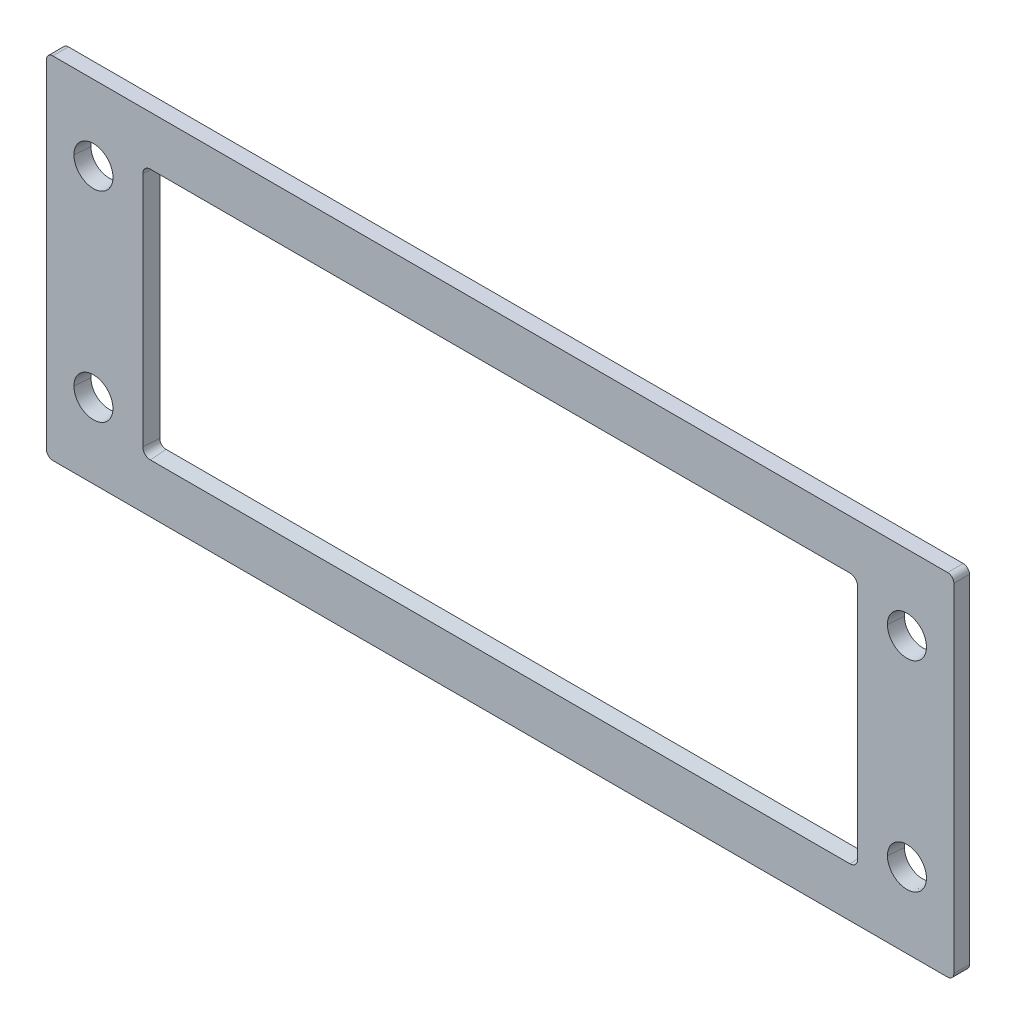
ISO-10303-21;
HEADER;
FILE_DESCRIPTION(('STEP AP214'),'2;1');
FILE_NAME('part.step','',(''),(''),'','','');
FILE_SCHEMA(('AUTOMOTIVE_DESIGN { 1 0 10303 214 1 1 1 1 }'));
ENDSEC;
DATA;
#1=APPLICATION_CONTEXT('core data for automotive mechanical design processes');
#2=APPLICATION_PROTOCOL_DEFINITION('international standard','automotive_design',2000,#1);
#3=PRODUCT_CONTEXT('',#1,'mechanical');
#4=PRODUCT('Part','Part','',(#3));
#5=PRODUCT_RELATED_PRODUCT_CATEGORY('part','',(#4));
#6=PRODUCT_DEFINITION_FORMATION('','',#4);
#7=PRODUCT_DEFINITION_CONTEXT('part definition',#1,'design');
#8=PRODUCT_DEFINITION('design','',#6,#7);
#9=PRODUCT_DEFINITION_SHAPE('','',#8);
#10=(LENGTH_UNIT() NAMED_UNIT(*) SI_UNIT(.MILLI.,.METRE.));
#11=(NAMED_UNIT(*) PLANE_ANGLE_UNIT() SI_UNIT($,.RADIAN.));
#12=(NAMED_UNIT(*) SI_UNIT($,.STERADIAN.) SOLID_ANGLE_UNIT());
#13=UNCERTAINTY_MEASURE_WITH_UNIT(LENGTH_MEASURE(1.E-05),#10,'distance_accuracy_value','');
#14=(GEOMETRIC_REPRESENTATION_CONTEXT(3) GLOBAL_UNCERTAINTY_ASSIGNED_CONTEXT((#13)) GLOBAL_UNIT_ASSIGNED_CONTEXT((#10,
#11,#12)) REPRESENTATION_CONTEXT('',''));
#15=CARTESIAN_POINT('',(0.,0.,0.));
#16=DIRECTION('',(0.,0.,1.));
#17=DIRECTION('',(1.,0.,0.));
#18=AXIS2_PLACEMENT_3D('',#15,#16,#17);
#19=CARTESIAN_POINT('',(17.6,10.1,-2.49999999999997));
#20=DIRECTION('',(0.,0.,1.));
#21=DIRECTION('',(-1.,0.,0.));
#22=AXIS2_PLACEMENT_3D('',#19,#20,#21);
#23=CONICAL_SURFACE('',#22,1.,0.0872664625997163);
#24=CARTESIAN_POINT('',(17.6,10.1,0.));
#25=DIRECTION('',(0.,0.,-1.));
#26=DIRECTION('',(-1.,0.,0.));
#27=AXIS2_PLACEMENT_3D('',#24,#25,#26);
#28=CIRCLE('',#27,1.21872165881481);
#29=CARTESIAN_POINT('',(17.6,8.88127834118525,0.));
#30=VERTEX_POINT('',#29);
#31=CARTESIAN_POINT('',(16.3812783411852,10.1,0.));
#32=VERTEX_POINT('',#31);
#33=EDGE_CURVE('E254',#30,#32,#28,.T.);
#34=ORIENTED_EDGE('',*,*,#33,.F.);
#35=DIRECTION('',(0.,-0.0871557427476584,0.996194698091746));
#36=VECTOR('',#35,1.);
#37=CARTESIAN_POINT('',(17.6,9.1,-2.49999999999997));
#38=LINE('',#37,#36);
#39=CARTESIAN_POINT('',(17.6,9.1,-2.49999999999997));
#40=VERTEX_POINT('',#39);
#41=EDGE_CURVE('E10',#40,#30,#38,.T.);
#42=ORIENTED_EDGE('',*,*,#41,.F.);
#43=CARTESIAN_POINT('',(17.6,10.1,-2.49999999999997));
#44=DIRECTION('',(0.,0.,1.));
#45=DIRECTION('',(-1.,0.,0.));
#46=AXIS2_PLACEMENT_3D('',#43,#44,#45);
#47=CIRCLE('',#46,1.);
#48=CARTESIAN_POINT('',(16.6,10.1,-2.49999999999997));
#49=VERTEX_POINT('',#48);
#50=EDGE_CURVE('E334',#49,#40,#47,.T.);
#51=ORIENTED_EDGE('',*,*,#50,.F.);
#52=DIRECTION('',(0.0871557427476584,0.,-0.996194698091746));
#53=VECTOR('',#52,1.);
#54=CARTESIAN_POINT('',(16.6,10.1,-2.49999999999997));
#55=LINE('',#54,#53);
#56=EDGE_CURVE('E124',#32,#49,#55,.T.);
#57=ORIENTED_EDGE('',*,*,#56,.F.);
#58=EDGE_LOOP('',(#34,#42,#51,#57));
#59=FACE_BOUND('',#58,.T.);
#60=ADVANCED_FACE('F15',(#59),#23,.F.);
#61=CARTESIAN_POINT('',(17.6,47.9,-2.49999999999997));
#62=DIRECTION('',(0.,0.,1.));
#63=DIRECTION('',(-1.,0.,0.));
#64=AXIS2_PLACEMENT_3D('',#61,#62,#63);
#65=CONICAL_SURFACE('',#64,1.,0.0872664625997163);
#66=CARTESIAN_POINT('',(17.6,47.9,0.));
#67=DIRECTION('',(0.,0.,-1.));
#68=DIRECTION('',(-1.,0.,0.));
#69=AXIS2_PLACEMENT_3D('',#66,#67,#68);
#70=CIRCLE('',#69,1.21872165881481);
#71=CARTESIAN_POINT('',(16.3812783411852,47.9,0.));
#72=VERTEX_POINT('',#71);
#73=CARTESIAN_POINT('',(17.6,49.1187216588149,0.));
#74=VERTEX_POINT('',#73);
#75=EDGE_CURVE('E268',#72,#74,#70,.T.);
#76=ORIENTED_EDGE('',*,*,#75,.F.);
#77=DIRECTION('',(-0.0871557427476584,0.,0.996194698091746));
#78=VECTOR('',#77,1.);
#79=CARTESIAN_POINT('',(16.6,47.9,-2.49999999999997));
#80=LINE('',#79,#78);
#81=CARTESIAN_POINT('',(16.6,47.9,-2.49999999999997));
#82=VERTEX_POINT('',#81);
#83=EDGE_CURVE('E116',#82,#72,#80,.T.);
#84=ORIENTED_EDGE('',*,*,#83,.F.);
#85=CARTESIAN_POINT('',(17.6,47.9,-2.49999999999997));
#86=DIRECTION('',(0.,0.,1.));
#87=DIRECTION('',(-1.,0.,0.));
#88=AXIS2_PLACEMENT_3D('',#85,#86,#87);
#89=CIRCLE('',#88,1.);
#90=CARTESIAN_POINT('',(17.6,48.9,-2.49999999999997));
#91=VERTEX_POINT('',#90);
#92=EDGE_CURVE('E216',#91,#82,#89,.T.);
#93=ORIENTED_EDGE('',*,*,#92,.F.);
#94=DIRECTION('',(0.,-0.0871557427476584,-0.996194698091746));
#95=VECTOR('',#94,1.);
#96=CARTESIAN_POINT('',(17.6,48.9,-2.49999999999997));
#97=LINE('',#96,#95);
#98=EDGE_CURVE('E38',#74,#91,#97,.T.);
#99=ORIENTED_EDGE('',*,*,#98,.F.);
#100=EDGE_LOOP('',(#76,#84,#93,#99));
#101=FACE_BOUND('',#100,.T.);
#102=ADVANCED_FACE('F476',(#101),#65,.F.);
#103=CARTESIAN_POINT('',(129.4,47.9,-2.49999999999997));
#104=DIRECTION('',(0.,0.,1.));
#105=DIRECTION('',(-1.,0.,0.));
#106=AXIS2_PLACEMENT_3D('',#103,#104,#105);
#107=CONICAL_SURFACE('',#106,1.,0.0872664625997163);
#108=CARTESIAN_POINT('',(129.4,47.9,0.));
#109=DIRECTION('',(0.,0.,-1.));
#110=DIRECTION('',(-1.,0.,0.));
#111=AXIS2_PLACEMENT_3D('',#108,#109,#110);
#112=CIRCLE('',#111,1.21872165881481);
#113=CARTESIAN_POINT('',(129.4,49.1187216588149,0.));
#114=VERTEX_POINT('',#113);
#115=CARTESIAN_POINT('',(130.618721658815,47.9,0.));
#116=VERTEX_POINT('',#115);
#117=EDGE_CURVE('E278',#114,#116,#112,.T.);
#118=ORIENTED_EDGE('',*,*,#117,.F.);
#119=DIRECTION('',(0.,0.0871557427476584,0.996194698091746));
#120=VECTOR('',#119,1.);
#121=CARTESIAN_POINT('',(129.4,48.9,-2.49999999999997));
#122=LINE('',#121,#120);
#123=CARTESIAN_POINT('',(129.4,48.9,-2.49999999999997));
#124=VERTEX_POINT('',#123);
#125=EDGE_CURVE('E270',#124,#114,#122,.T.);
#126=ORIENTED_EDGE('',*,*,#125,.F.);
#127=CARTESIAN_POINT('',(129.4,47.9,-2.49999999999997));
#128=DIRECTION('',(0.,0.,1.));
#129=DIRECTION('',(-1.,0.,0.));
#130=AXIS2_PLACEMENT_3D('',#127,#128,#129);
#131=CIRCLE('',#130,1.);
#132=CARTESIAN_POINT('',(130.4,47.9,-2.49999999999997));
#133=VERTEX_POINT('',#132);
#134=EDGE_CURVE('E213',#133,#124,#131,.T.);
#135=ORIENTED_EDGE('',*,*,#134,.F.);
#136=DIRECTION('',(-0.0871557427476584,0.,-0.996194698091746));
#137=VECTOR('',#136,1.);
#138=CARTESIAN_POINT('',(130.4,47.9,-2.49999999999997));
#139=LINE('',#138,#137);
#140=EDGE_CURVE('E221',#116,#133,#139,.T.);
#141=ORIENTED_EDGE('',*,*,#140,.F.);
#142=EDGE_LOOP('',(#118,#126,#135,#141));
#143=FACE_BOUND('',#142,.T.);
#144=ADVANCED_FACE('F456',(#143),#107,.F.);
#145=CARTESIAN_POINT('',(129.4,10.1,-2.49999999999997));
#146=DIRECTION('',(0.,0.,1.));
#147=DIRECTION('',(-1.,0.,0.));
#148=AXIS2_PLACEMENT_3D('',#145,#146,#147);
#149=CONICAL_SURFACE('',#148,1.,0.0872664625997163);
#150=CARTESIAN_POINT('',(129.4,10.1,0.));
#151=DIRECTION('',(0.,0.,-1.));
#152=DIRECTION('',(-1.,0.,0.));
#153=AXIS2_PLACEMENT_3D('',#150,#151,#152);
#154=CIRCLE('',#153,1.21872165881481);
#155=CARTESIAN_POINT('',(130.618721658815,10.1,0.));
#156=VERTEX_POINT('',#155);
#157=CARTESIAN_POINT('',(129.4,8.88127834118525,0.));
#158=VERTEX_POINT('',#157);
#159=EDGE_CURVE('E243',#156,#158,#154,.T.);
#160=ORIENTED_EDGE('',*,*,#159,.F.);
#161=DIRECTION('',(0.0871557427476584,0.,0.996194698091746));
#162=VECTOR('',#161,1.);
#163=CARTESIAN_POINT('',(130.4,10.1,-2.49999999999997));
#164=LINE('',#163,#162);
#165=CARTESIAN_POINT('',(130.4,10.1,-2.49999999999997));
#166=VERTEX_POINT('',#165);
#167=EDGE_CURVE('E218',#166,#156,#164,.T.);
#168=ORIENTED_EDGE('',*,*,#167,.F.);
#169=CARTESIAN_POINT('',(129.4,10.1,-2.49999999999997));
#170=DIRECTION('',(0.,0.,1.));
#171=DIRECTION('',(-1.,0.,0.));
#172=AXIS2_PLACEMENT_3D('',#169,#170,#171);
#173=CIRCLE('',#172,1.);
#174=CARTESIAN_POINT('',(129.4,9.1,-2.49999999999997));
#175=VERTEX_POINT('',#174);
#176=EDGE_CURVE('E434',#175,#166,#173,.T.);
#177=ORIENTED_EDGE('',*,*,#176,.F.);
#178=DIRECTION('',(0.,0.0871557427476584,-0.996194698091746));
#179=VECTOR('',#178,1.);
#180=CARTESIAN_POINT('',(129.4,9.1,-2.49999999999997));
#181=LINE('',#180,#179);
#182=EDGE_CURVE('E18',#158,#175,#181,.T.);
#183=ORIENTED_EDGE('',*,*,#182,.F.);
#184=EDGE_LOOP('',(#160,#168,#177,#183));
#185=FACE_BOUND('',#184,.T.);
#186=ADVANCED_FACE('F488',(#185),#149,.F.);
#187=CARTESIAN_POINT('',(2.,56.,0.));
#188=DIRECTION('',(0.,0.,-1.));
#189=DIRECTION('',(-1.,0.,0.));
#190=AXIS2_PLACEMENT_3D('',#187,#188,#189);
#191=CYLINDRICAL_SURFACE('',#190,1.);
#192=CARTESIAN_POINT('',(2.,56.,0.));
#193=DIRECTION('',(0.,0.,1.));
#194=DIRECTION('',(-1.,0.,0.));
#195=AXIS2_PLACEMENT_3D('',#192,#193,#194);
#196=CIRCLE('',#195,1.);
#197=CARTESIAN_POINT('',(2.,57.,0.));
#198=VERTEX_POINT('',#197);
#199=CARTESIAN_POINT('',(1.,56.,0.));
#200=VERTEX_POINT('',#199);
#201=EDGE_CURVE('E202',#198,#200,#196,.T.);
#202=ORIENTED_EDGE('',*,*,#201,.F.);
#203=DIRECTION('',(0.,0.,1.));
#204=VECTOR('',#203,1.);
#205=CARTESIAN_POINT('',(2.,57.,0.));
#206=LINE('',#205,#204);
#207=CARTESIAN_POINT('',(2.,57.,-2.49999999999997));
#208=VERTEX_POINT('',#207);
#209=EDGE_CURVE('E187',#208,#198,#206,.T.);
#210=ORIENTED_EDGE('',*,*,#209,.F.);
#211=CARTESIAN_POINT('',(2.,56.,-2.49999999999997));
#212=DIRECTION('',(0.,0.,-1.));
#213=DIRECTION('',(-1.,0.,0.));
#214=AXIS2_PLACEMENT_3D('',#211,#212,#213);
#215=CIRCLE('',#214,1.);
#216=CARTESIAN_POINT('',(1.,56.,-2.49999999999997));
#217=VERTEX_POINT('',#216);
#218=EDGE_CURVE('E318',#217,#208,#215,.T.);
#219=ORIENTED_EDGE('',*,*,#218,.F.);
#220=DIRECTION('',(0.,0.,-1.));
#221=VECTOR('',#220,1.);
#222=CARTESIAN_POINT('',(1.,56.,0.));
#223=LINE('',#222,#221);
#224=EDGE_CURVE('E169',#200,#217,#223,.T.);
#225=ORIENTED_EDGE('',*,*,#224,.F.);
#226=EDGE_LOOP('',(#202,#210,#219,#225));
#227=FACE_BOUND('',#226,.T.);
#228=ADVANCED_FACE('F490',(#227),#191,.T.);
#229=CARTESIAN_POINT('',(2.,2.00000000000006,0.));
#230=DIRECTION('',(0.,0.,-1.));
#231=DIRECTION('',(-1.,0.,0.));
#232=AXIS2_PLACEMENT_3D('',#229,#230,#231);
#233=CYLINDRICAL_SURFACE('',#232,1.);
#234=CARTESIAN_POINT('',(2.,2.00000000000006,0.));
#235=DIRECTION('',(0.,0.,1.));
#236=DIRECTION('',(-1.,0.,0.));
#237=AXIS2_PLACEMENT_3D('',#234,#235,#236);
#238=CIRCLE('',#237,1.);
#239=CARTESIAN_POINT('',(1.,2.00000000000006,0.));
#240=VERTEX_POINT('',#239);
#241=CARTESIAN_POINT('',(2.,1.00000000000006,0.));
#242=VERTEX_POINT('',#241);
#243=EDGE_CURVE('E190',#240,#242,#238,.T.);
#244=ORIENTED_EDGE('',*,*,#243,.F.);
#245=DIRECTION('',(0.,0.,1.));
#246=VECTOR('',#245,1.);
#247=CARTESIAN_POINT('',(1.,2.00000000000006,0.));
#248=LINE('',#247,#246);
#249=CARTESIAN_POINT('',(1.,2.00000000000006,-2.49999999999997));
#250=VERTEX_POINT('',#249);
#251=EDGE_CURVE('E175',#250,#240,#248,.T.);
#252=ORIENTED_EDGE('',*,*,#251,.F.);
#253=CARTESIAN_POINT('',(2.,2.00000000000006,-2.49999999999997));
#254=DIRECTION('',(0.,0.,-1.));
#255=DIRECTION('',(-1.,0.,0.));
#256=AXIS2_PLACEMENT_3D('',#253,#254,#255);
#257=CIRCLE('',#256,1.);
#258=CARTESIAN_POINT('',(2.,1.00000000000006,-2.49999999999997));
#259=VERTEX_POINT('',#258);
#260=EDGE_CURVE('E313',#259,#250,#257,.T.);
#261=ORIENTED_EDGE('',*,*,#260,.F.);
#262=DIRECTION('',(0.,0.,-1.));
#263=VECTOR('',#262,1.);
#264=CARTESIAN_POINT('',(2.,1.00000000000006,0.));
#265=LINE('',#264,#263);
#266=EDGE_CURVE('E192',#242,#259,#265,.T.);
#267=ORIENTED_EDGE('',*,*,#266,.F.);
#268=EDGE_LOOP('',(#244,#252,#261,#267));
#269=FACE_BOUND('',#268,.T.);
#270=ADVANCED_FACE('F191',(#269),#233,.T.);
#271=CARTESIAN_POINT('',(145.,2.00000000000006,0.));
#272=DIRECTION('',(0.,0.,-1.));
#273=DIRECTION('',(-1.,0.,0.));
#274=AXIS2_PLACEMENT_3D('',#271,#272,#273);
#275=CYLINDRICAL_SURFACE('',#274,1.);
#276=CARTESIAN_POINT('',(145.,2.00000000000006,0.));
#277=DIRECTION('',(0.,0.,1.));
#278=DIRECTION('',(-1.,0.,0.));
#279=AXIS2_PLACEMENT_3D('',#276,#277,#278);
#280=CIRCLE('',#279,1.);
#281=CARTESIAN_POINT('',(145.,1.00000000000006,0.));
#282=VERTEX_POINT('',#281);
#283=CARTESIAN_POINT('',(146.,2.00000000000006,0.));
#284=VERTEX_POINT('',#283);
#285=EDGE_CURVE('E227',#282,#284,#280,.T.);
#286=ORIENTED_EDGE('',*,*,#285,.F.);
#287=DIRECTION('',(0.,0.,1.));
#288=VECTOR('',#287,1.);
#289=CARTESIAN_POINT('',(145.,1.00000000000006,0.));
#290=LINE('',#289,#288);
#291=CARTESIAN_POINT('',(145.,1.00000000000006,-2.49999999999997));
#292=VERTEX_POINT('',#291);
#293=EDGE_CURVE('E257',#292,#282,#290,.T.);
#294=ORIENTED_EDGE('',*,*,#293,.F.);
#295=CARTESIAN_POINT('',(145.,2.00000000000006,-2.49999999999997));
#296=DIRECTION('',(0.,0.,-1.));
#297=DIRECTION('',(-1.,0.,0.));
#298=AXIS2_PLACEMENT_3D('',#295,#296,#297);
#299=CIRCLE('',#298,1.);
#300=CARTESIAN_POINT('',(146.,2.00000000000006,-2.49999999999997));
#301=VERTEX_POINT('',#300);
#302=EDGE_CURVE('E305',#301,#292,#299,.T.);
#303=ORIENTED_EDGE('',*,*,#302,.F.);
#304=DIRECTION('',(0.,0.,-1.));
#305=VECTOR('',#304,1.);
#306=CARTESIAN_POINT('',(146.,2.00000000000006,0.));
#307=LINE('',#306,#305);
#308=EDGE_CURVE('E246',#284,#301,#307,.T.);
#309=ORIENTED_EDGE('',*,*,#308,.F.);
#310=EDGE_LOOP('',(#286,#294,#303,#309));
#311=FACE_BOUND('',#310,.T.);
#312=ADVANCED_FACE('F501',(#311),#275,.T.);
#313=CARTESIAN_POINT('',(145.,56.,0.));
#314=DIRECTION('',(0.,0.,-1.));
#315=DIRECTION('',(-1.,0.,0.));
#316=AXIS2_PLACEMENT_3D('',#313,#314,#315);
#317=CYLINDRICAL_SURFACE('',#316,1.);
#318=CARTESIAN_POINT('',(145.,56.,0.));
#319=DIRECTION('',(0.,0.,1.));
#320=DIRECTION('',(-1.,0.,0.));
#321=AXIS2_PLACEMENT_3D('',#318,#319,#320);
#322=CIRCLE('',#321,1.);
#323=CARTESIAN_POINT('',(146.,56.,0.));
#324=VERTEX_POINT('',#323);
#325=CARTESIAN_POINT('',(145.,57.,0.));
#326=VERTEX_POINT('',#325);
#327=EDGE_CURVE('E430',#324,#326,#322,.T.);
#328=ORIENTED_EDGE('',*,*,#327,.F.);
#329=DIRECTION('',(0.,0.,1.));
#330=VECTOR('',#329,1.);
#331=CARTESIAN_POINT('',(146.,56.,0.));
#332=LINE('',#331,#330);
#333=CARTESIAN_POINT('',(146.,56.,-2.49999999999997));
#334=VERTEX_POINT('',#333);
#335=EDGE_CURVE('E239',#334,#324,#332,.T.);
#336=ORIENTED_EDGE('',*,*,#335,.F.);
#337=CARTESIAN_POINT('',(145.,56.,-2.49999999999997));
#338=DIRECTION('',(0.,0.,-1.));
#339=DIRECTION('',(-1.,0.,0.));
#340=AXIS2_PLACEMENT_3D('',#337,#338,#339);
#341=CIRCLE('',#340,1.);
#342=CARTESIAN_POINT('',(145.,57.,-2.49999999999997));
#343=VERTEX_POINT('',#342);
#344=EDGE_CURVE('E300',#343,#334,#341,.T.);
#345=ORIENTED_EDGE('',*,*,#344,.F.);
#346=DIRECTION('',(0.,0.,-1.));
#347=VECTOR('',#346,1.);
#348=CARTESIAN_POINT('',(145.,57.,0.));
#349=LINE('',#348,#347);
#350=EDGE_CURVE('E258',#326,#343,#349,.T.);
#351=ORIENTED_EDGE('',*,*,#350,.F.);
#352=EDGE_LOOP('',(#328,#336,#345,#351));
#353=FACE_BOUND('',#352,.T.);
#354=ADVANCED_FACE('F504',(#353),#317,.T.);
#355=CARTESIAN_POINT('',(138.5,13.,-2.49999999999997));
#356=DIRECTION('',(0.,0.,1.));
#357=DIRECTION('',(1.,0.,0.));
#358=AXIS2_PLACEMENT_3D('',#355,#356,#357);
#359=CONICAL_SURFACE('',#358,2.9,0.0872664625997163);
#360=DIRECTION('',(-0.0871557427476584,0.,0.996194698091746));
#361=VECTOR('',#360,1.);
#362=CARTESIAN_POINT('',(135.6,13.,-2.49999999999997));
#363=LINE('',#362,#361);
#364=CARTESIAN_POINT('',(135.6,13.,-2.49999999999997));
#365=VERTEX_POINT('',#364);
#366=CARTESIAN_POINT('',(135.381278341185,13.,0.));
#367=VERTEX_POINT('',#366);
#368=EDGE_CURVE('E362',#365,#367,#363,.T.);
#369=ORIENTED_EDGE('',*,*,#368,.F.);
#370=CARTESIAN_POINT('',(138.5,13.,-2.49999999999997));
#371=DIRECTION('',(0.,0.,1.));
#372=DIRECTION('',(1.,0.,0.));
#373=AXIS2_PLACEMENT_3D('',#370,#371,#372);
#374=CIRCLE('',#373,2.9);
#375=CARTESIAN_POINT('',(141.4,13.,-2.49999999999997));
#376=VERTEX_POINT('',#375);
#377=EDGE_CURVE('E231',#376,#365,#374,.T.);
#378=ORIENTED_EDGE('',*,*,#377,.F.);
#379=DIRECTION('',(0.0871557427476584,0.,0.996194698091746));
#380=VECTOR('',#379,1.);
#381=CARTESIAN_POINT('',(141.4,13.,-2.49999999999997));
#382=LINE('',#381,#380);
#383=CARTESIAN_POINT('',(141.618721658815,13.,0.));
#384=VERTEX_POINT('',#383);
#385=EDGE_CURVE('E384',#376,#384,#382,.T.);
#386=ORIENTED_EDGE('',*,*,#385,.T.);
#387=CARTESIAN_POINT('',(138.5,13.,0.));
#388=DIRECTION('',(0.,0.,1.));
#389=DIRECTION('',(-1.,0.,0.));
#390=AXIS2_PLACEMENT_3D('',#387,#388,#389);
#391=CIRCLE('',#390,3.11872165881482);
#392=EDGE_CURVE('E295',#384,#367,#391,.T.);
#393=ORIENTED_EDGE('',*,*,#392,.T.);
#394=EDGE_LOOP('',(#369,#378,#386,#393));
#395=FACE_BOUND('',#394,.T.);
#396=ADVANCED_FACE('F508',(#395),#359,.F.);
#397=CARTESIAN_POINT('',(8.5,13.,-2.49999999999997));
#398=DIRECTION('',(0.,0.,1.));
#399=DIRECTION('',(-1.,0.,0.));
#400=AXIS2_PLACEMENT_3D('',#397,#398,#399);
#401=CONICAL_SURFACE('',#400,2.9,0.0872664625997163);
#402=DIRECTION('',(0.0871557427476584,0.,0.996194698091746));
#403=VECTOR('',#402,1.);
#404=CARTESIAN_POINT('',(11.4,13.,-2.49999999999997));
#405=LINE('',#404,#403);
#406=CARTESIAN_POINT('',(11.4,13.,-2.49999999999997));
#407=VERTEX_POINT('',#406);
#408=CARTESIAN_POINT('',(11.6187216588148,13.,0.));
#409=VERTEX_POINT('',#408);
#410=EDGE_CURVE('E398',#407,#409,#405,.T.);
#411=ORIENTED_EDGE('',*,*,#410,.F.);
#412=CARTESIAN_POINT('',(8.5,13.,-2.49999999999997));
#413=DIRECTION('',(0.,0.,1.));
#414=DIRECTION('',(-1.,0.,0.));
#415=AXIS2_PLACEMENT_3D('',#412,#413,#414);
#416=CIRCLE('',#415,2.9);
#417=CARTESIAN_POINT('',(5.6,13.,-2.49999999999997));
#418=VERTEX_POINT('',#417);
#419=EDGE_CURVE('E322',#418,#407,#416,.T.);
#420=ORIENTED_EDGE('',*,*,#419,.F.);
#421=DIRECTION('',(-0.0871557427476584,0.,0.996194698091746));
#422=VECTOR('',#421,1.);
#423=CARTESIAN_POINT('',(5.6,13.,-2.49999999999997));
#424=LINE('',#423,#422);
#425=CARTESIAN_POINT('',(5.38127834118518,13.,0.));
#426=VERTEX_POINT('',#425);
#427=EDGE_CURVE('E371',#418,#426,#424,.T.);
#428=ORIENTED_EDGE('',*,*,#427,.T.);
#429=CARTESIAN_POINT('',(8.5,13.,0.));
#430=DIRECTION('',(0.,0.,1.));
#431=DIRECTION('',(-1.,0.,0.));
#432=AXIS2_PLACEMENT_3D('',#429,#430,#431);
#433=CIRCLE('',#432,3.11872165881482);
#434=EDGE_CURVE('E293',#426,#409,#433,.T.);
#435=ORIENTED_EDGE('',*,*,#434,.T.);
#436=EDGE_LOOP('',(#411,#420,#428,#435));
#437=FACE_BOUND('',#436,.T.);
#438=ADVANCED_FACE('F512',(#437),#401,.F.);
#439=CARTESIAN_POINT('',(138.5,45.,-2.49999999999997));
#440=DIRECTION('',(0.,0.,1.));
#441=DIRECTION('',(-1.,0.,0.));
#442=AXIS2_PLACEMENT_3D('',#439,#440,#441);
#443=CONICAL_SURFACE('',#442,2.9,0.0872664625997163);
#444=DIRECTION('',(0.0871557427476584,0.,0.996194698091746));
#445=VECTOR('',#444,1.);
#446=CARTESIAN_POINT('',(141.4,45.,-2.49999999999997));
#447=LINE('',#446,#445);
#448=CARTESIAN_POINT('',(141.4,45.,-2.49999999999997));
#449=VERTEX_POINT('',#448);
#450=CARTESIAN_POINT('',(141.618721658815,45.,0.));
#451=VERTEX_POINT('',#450);
#452=EDGE_CURVE('E370',#449,#451,#447,.T.);
#453=ORIENTED_EDGE('',*,*,#452,.F.);
#454=CARTESIAN_POINT('',(138.5,45.,-2.49999999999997));
#455=DIRECTION('',(0.,0.,1.));
#456=DIRECTION('',(-1.,0.,0.));
#457=AXIS2_PLACEMENT_3D('',#454,#455,#456);
#458=CIRCLE('',#457,2.9);
#459=CARTESIAN_POINT('',(135.6,45.,-2.49999999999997));
#460=VERTEX_POINT('',#459);
#461=EDGE_CURVE('E224',#460,#449,#458,.T.);
#462=ORIENTED_EDGE('',*,*,#461,.F.);
#463=DIRECTION('',(-0.0871557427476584,0.,0.996194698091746));
#464=VECTOR('',#463,1.);
#465=CARTESIAN_POINT('',(135.6,45.,-2.49999999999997));
#466=LINE('',#465,#464);
#467=CARTESIAN_POINT('',(135.381278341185,45.,0.));
#468=VERTEX_POINT('',#467);
#469=EDGE_CURVE('E350',#460,#468,#466,.T.);
#470=ORIENTED_EDGE('',*,*,#469,.T.);
#471=CARTESIAN_POINT('',(138.5,45.,0.));
#472=DIRECTION('',(0.,0.,1.));
#473=DIRECTION('',(-1.,0.,0.));
#474=AXIS2_PLACEMENT_3D('',#471,#472,#473);
#475=CIRCLE('',#474,3.11872165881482);
#476=EDGE_CURVE('E290',#468,#451,#475,.T.);
#477=ORIENTED_EDGE('',*,*,#476,.T.);
#478=EDGE_LOOP('',(#453,#462,#470,#477));
#479=FACE_BOUND('',#478,.T.);
#480=ADVANCED_FACE('F515',(#479),#443,.F.);
#481=CARTESIAN_POINT('',(8.5,45.,-2.49999999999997));
#482=DIRECTION('',(0.,0.,1.));
#483=DIRECTION('',(1.,0.,0.));
#484=AXIS2_PLACEMENT_3D('',#481,#482,#483);
#485=CONICAL_SURFACE('',#484,2.9,0.0872664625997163);
#486=DIRECTION('',(-0.0871557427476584,0.,0.996194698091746));
#487=VECTOR('',#486,1.);
#488=CARTESIAN_POINT('',(5.6,45.,-2.49999999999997));
#489=LINE('',#488,#487);
#490=CARTESIAN_POINT('',(5.6,45.,-2.49999999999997));
#491=VERTEX_POINT('',#490);
#492=CARTESIAN_POINT('',(5.38127834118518,45.,0.));
#493=VERTEX_POINT('',#492);
#494=EDGE_CURVE('E403',#491,#493,#489,.T.);
#495=ORIENTED_EDGE('',*,*,#494,.F.);
#496=CARTESIAN_POINT('',(8.5,45.,-2.49999999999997));
#497=DIRECTION('',(0.,0.,1.));
#498=DIRECTION('',(1.,0.,0.));
#499=AXIS2_PLACEMENT_3D('',#496,#497,#498);
#500=CIRCLE('',#499,2.9);
#501=CARTESIAN_POINT('',(11.4,45.,-2.49999999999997));
#502=VERTEX_POINT('',#501);
#503=EDGE_CURVE('E326',#502,#491,#500,.T.);
#504=ORIENTED_EDGE('',*,*,#503,.F.);
#505=DIRECTION('',(0.0871557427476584,0.,0.996194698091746));
#506=VECTOR('',#505,1.);
#507=CARTESIAN_POINT('',(11.4,45.,-2.49999999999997));
#508=LINE('',#507,#506);
#509=CARTESIAN_POINT('',(11.6187216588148,45.,0.));
#510=VERTEX_POINT('',#509);
#511=EDGE_CURVE('E417',#502,#510,#508,.T.);
#512=ORIENTED_EDGE('',*,*,#511,.T.);
#513=CARTESIAN_POINT('',(8.5,45.,0.));
#514=DIRECTION('',(0.,0.,1.));
#515=DIRECTION('',(-1.,0.,0.));
#516=AXIS2_PLACEMENT_3D('',#513,#514,#515);
#517=CIRCLE('',#516,3.11872165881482);
#518=EDGE_CURVE('E286',#510,#493,#517,.T.);
#519=ORIENTED_EDGE('',*,*,#518,.T.);
#520=EDGE_LOOP('',(#495,#504,#512,#519));
#521=FACE_BOUND('',#520,.T.);
#522=ADVANCED_FACE('F518',(#521),#485,.F.);
#523=CARTESIAN_POINT('',(16.6,9.1,-2.49999999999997));
#524=DIRECTION('',(0.,0.996194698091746,0.0871557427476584));
#525=DIRECTION('',(1.,0.,0.));
#526=AXIS2_PLACEMENT_3D('',#523,#524,#525);
#527=PLANE('',#526);
#528=DIRECTION('',(1.,0.,0.));
#529=VECTOR('',#528,1.);
#530=CARTESIAN_POINT('',(73.5,8.88127834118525,0.));
#531=LINE('',#530,#529);
#532=EDGE_CURVE('E250',#30,#158,#531,.T.);
#533=ORIENTED_EDGE('',*,*,#532,.T.);
#534=ORIENTED_EDGE('',*,*,#182,.T.);
#535=DIRECTION('',(1.,0.,0.));
#536=VECTOR('',#535,1.);
#537=CARTESIAN_POINT('',(16.6,9.1,-2.49999999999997));
#538=LINE('',#537,#536);
#539=EDGE_CURVE('E338',#40,#175,#538,.T.);
#540=ORIENTED_EDGE('',*,*,#539,.F.);
#541=ORIENTED_EDGE('',*,*,#41,.T.);
#542=EDGE_LOOP('',(#533,#534,#540,#541));
#543=FACE_BOUND('',#542,.T.);
#544=ADVANCED_FACE('F471',(#543),#527,.T.);
#545=CARTESIAN_POINT('',(16.6,9.1,-2.49999999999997));
#546=DIRECTION('',(0.996194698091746,0.,0.0871557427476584));
#547=DIRECTION('',(0.,-1.,0.));
#548=AXIS2_PLACEMENT_3D('',#545,#546,#547);
#549=PLANE('',#548);
#550=DIRECTION('',(0.,-1.,0.));
#551=VECTOR('',#550,1.);
#552=CARTESIAN_POINT('',(16.6,9.1,-2.49999999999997));
#553=LINE('',#552,#551);
#554=EDGE_CURVE('E330',#82,#49,#553,.T.);
#555=ORIENTED_EDGE('',*,*,#554,.F.);
#556=ORIENTED_EDGE('',*,*,#83,.T.);
#557=DIRECTION('',(0.,-1.,0.));
#558=VECTOR('',#557,1.);
#559=CARTESIAN_POINT('',(16.3812783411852,29.,0.));
#560=LINE('',#559,#558);
#561=EDGE_CURVE('E265',#72,#32,#560,.T.);
#562=ORIENTED_EDGE('',*,*,#561,.T.);
#563=ORIENTED_EDGE('',*,*,#56,.T.);
#564=EDGE_LOOP('',(#555,#556,#562,#563));
#565=FACE_BOUND('',#564,.T.);
#566=ADVANCED_FACE('F461',(#565),#549,.T.);
#567=CARTESIAN_POINT('',(16.6,48.9,-2.49999999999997));
#568=DIRECTION('',(0.,-0.996194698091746,0.0871557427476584));
#569=DIRECTION('',(-1.,0.,0.));
#570=AXIS2_PLACEMENT_3D('',#567,#568,#569);
#571=PLANE('',#570);
#572=DIRECTION('',(-1.,0.,0.));
#573=VECTOR('',#572,1.);
#574=CARTESIAN_POINT('',(16.6,48.9,-2.49999999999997));
#575=LINE('',#574,#573);
#576=EDGE_CURVE('E214',#124,#91,#575,.T.);
#577=ORIENTED_EDGE('',*,*,#576,.F.);
#578=ORIENTED_EDGE('',*,*,#125,.T.);
#579=DIRECTION('',(-1.,0.,0.));
#580=VECTOR('',#579,1.);
#581=CARTESIAN_POINT('',(73.5,49.1187216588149,0.));
#582=LINE('',#581,#580);
#583=EDGE_CURVE('E275',#114,#74,#582,.T.);
#584=ORIENTED_EDGE('',*,*,#583,.T.);
#585=ORIENTED_EDGE('',*,*,#98,.T.);
#586=EDGE_LOOP('',(#577,#578,#584,#585));
#587=FACE_BOUND('',#586,.T.);
#588=ADVANCED_FACE('F458',(#587),#571,.T.);
#589=CARTESIAN_POINT('',(130.4,9.1,-2.49999999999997));
#590=DIRECTION('',(-0.996194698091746,0.,0.0871557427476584));
#591=DIRECTION('',(0.,1.,0.));
#592=AXIS2_PLACEMENT_3D('',#589,#590,#591);
#593=PLANE('',#592);
#594=DIRECTION('',(0.,1.,0.));
#595=VECTOR('',#594,1.);
#596=CARTESIAN_POINT('',(130.4,9.1,-2.49999999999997));
#597=LINE('',#596,#595);
#598=EDGE_CURVE('E441',#166,#133,#597,.T.);
#599=ORIENTED_EDGE('',*,*,#598,.F.);
#600=ORIENTED_EDGE('',*,*,#167,.T.);
#601=DIRECTION('',(0.,1.,0.));
#602=VECTOR('',#601,1.);
#603=CARTESIAN_POINT('',(130.618721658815,29.,0.));
#604=LINE('',#603,#602);
#605=EDGE_CURVE('E235',#156,#116,#604,.T.);
#606=ORIENTED_EDGE('',*,*,#605,.T.);
#607=ORIENTED_EDGE('',*,*,#140,.T.);
#608=EDGE_LOOP('',(#599,#600,#606,#607));
#609=FACE_BOUND('',#608,.T.);
#610=ADVANCED_FACE('F460',(#609),#593,.T.);
#611=CARTESIAN_POINT('',(1.,1.00000000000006,0.));
#612=DIRECTION('',(0.,1.,0.));
#613=DIRECTION('',(1.,0.,0.));
#614=AXIS2_PLACEMENT_3D('',#611,#612,#613);
#615=PLANE('',#614);
#616=DIRECTION('',(1.,0.,0.));
#617=VECTOR('',#616,1.);
#618=CARTESIAN_POINT('',(1.,1.00000000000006,-2.49999999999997));
#619=LINE('',#618,#617);
#620=EDGE_CURVE('E309',#259,#292,#619,.T.);
#621=ORIENTED_EDGE('',*,*,#620,.T.);
#622=ORIENTED_EDGE('',*,*,#293,.T.);
#623=DIRECTION('',(1.,0.,0.));
#624=VECTOR('',#623,1.);
#625=CARTESIAN_POINT('',(1.,1.00000000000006,0.));
#626=LINE('',#625,#624);
#627=EDGE_CURVE('E197',#242,#282,#626,.T.);
#628=ORIENTED_EDGE('',*,*,#627,.F.);
#629=ORIENTED_EDGE('',*,*,#266,.T.);
#630=EDGE_LOOP('',(#621,#622,#628,#629));
#631=FACE_BOUND('',#630,.T.);
#632=ADVANCED_FACE('F468',(#631),#615,.F.);
#633=CARTESIAN_POINT('',(1.,1.00000000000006,0.));
#634=DIRECTION('',(1.,0.,0.));
#635=DIRECTION('',(0.,1.,0.));
#636=AXIS2_PLACEMENT_3D('',#633,#634,#635);
#637=PLANE('',#636);
#638=DIRECTION('',(0.,-1.,0.));
#639=VECTOR('',#638,1.);
#640=CARTESIAN_POINT('',(1.,1.00000000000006,-2.49999999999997));
#641=LINE('',#640,#639);
#642=EDGE_CURVE('E182',#217,#250,#641,.T.);
#643=ORIENTED_EDGE('',*,*,#642,.T.);
#644=ORIENTED_EDGE('',*,*,#251,.T.);
#645=DIRECTION('',(0.,-1.,0.));
#646=VECTOR('',#645,1.);
#647=CARTESIAN_POINT('',(1.,1.00000000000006,0.));
#648=LINE('',#647,#646);
#649=EDGE_CURVE('E179',#200,#240,#648,.T.);
#650=ORIENTED_EDGE('',*,*,#649,.F.);
#651=ORIENTED_EDGE('',*,*,#224,.T.);
#652=EDGE_LOOP('',(#643,#644,#650,#651));
#653=FACE_BOUND('',#652,.T.);
#654=ADVANCED_FACE('F177',(#653),#637,.F.);
#655=CARTESIAN_POINT('',(1.,57.,0.));
#656=DIRECTION('',(0.,-1.,0.));
#657=DIRECTION('',(0.,0.,-1.));
#658=AXIS2_PLACEMENT_3D('',#655,#656,#657);
#659=PLANE('',#658);
#660=DIRECTION('',(-1.,0.,0.));
#661=VECTOR('',#660,1.);
#662=CARTESIAN_POINT('',(1.,57.,0.));
#663=LINE('',#662,#661);
#664=EDGE_CURVE('E209',#326,#198,#663,.T.);
#665=ORIENTED_EDGE('',*,*,#664,.F.);
#666=ORIENTED_EDGE('',*,*,#350,.T.);
#667=DIRECTION('',(-1.,0.,0.));
#668=VECTOR('',#667,1.);
#669=CARTESIAN_POINT('',(1.,57.,-2.49999999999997));
#670=LINE('',#669,#668);
#671=EDGE_CURVE('E299',#343,#208,#670,.T.);
#672=ORIENTED_EDGE('',*,*,#671,.T.);
#673=ORIENTED_EDGE('',*,*,#209,.T.);
#674=EDGE_LOOP('',(#665,#666,#672,#673));
#675=FACE_BOUND('',#674,.T.);
#676=ADVANCED_FACE('F632',(#675),#659,.F.);
#677=CARTESIAN_POINT('',(146.,1.00000000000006,0.));
#678=DIRECTION('',(-1.,0.,0.));
#679=DIRECTION('',(0.,0.,1.));
#680=AXIS2_PLACEMENT_3D('',#677,#678,#679);
#681=PLANE('',#680);
#682=DIRECTION('',(0.,1.,0.));
#683=VECTOR('',#682,1.);
#684=CARTESIAN_POINT('',(146.,1.00000000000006,-2.49999999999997));
#685=LINE('',#684,#683);
#686=EDGE_CURVE('E304',#301,#334,#685,.T.);
#687=ORIENTED_EDGE('',*,*,#686,.T.);
#688=ORIENTED_EDGE('',*,*,#335,.T.);
#689=DIRECTION('',(0.,1.,0.));
#690=VECTOR('',#689,1.);
#691=CARTESIAN_POINT('',(146.,1.00000000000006,0.));
#692=LINE('',#691,#690);
#693=EDGE_CURVE('E427',#284,#324,#692,.T.);
#694=ORIENTED_EDGE('',*,*,#693,.F.);
#695=ORIENTED_EDGE('',*,*,#308,.T.);
#696=EDGE_LOOP('',(#687,#688,#694,#695));
#697=FACE_BOUND('',#696,.T.);
#698=ADVANCED_FACE('F580',(#697),#681,.F.);
#699=CARTESIAN_POINT('',(73.5,29.,-2.49999999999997));
#700=DIRECTION('',(0.,0.,-1.));
#701=DIRECTION('',(0.,-1.,0.));
#702=AXIS2_PLACEMENT_3D('',#699,#700,#701);
#703=PLANE('',#702);
#704=ORIENTED_EDGE('',*,*,#377,.T.);
#705=CARTESIAN_POINT('',(138.5,13.,-2.49999999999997));
#706=DIRECTION('',(0.,0.,1.));
#707=DIRECTION('',(1.,0.,0.));
#708=AXIS2_PLACEMENT_3D('',#705,#706,#707);
#709=CIRCLE('',#708,2.9);
#710=EDGE_CURVE('E358',#365,#376,#709,.T.);
#711=ORIENTED_EDGE('',*,*,#710,.T.);
#712=EDGE_LOOP('',(#704,#711));
#713=FACE_BOUND('',#712,.T.);
#714=ORIENTED_EDGE('',*,*,#461,.T.);
#715=CARTESIAN_POINT('',(138.5,45.,-2.49999999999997));
#716=DIRECTION('',(0.,0.,1.));
#717=DIRECTION('',(-1.,0.,0.));
#718=AXIS2_PLACEMENT_3D('',#715,#716,#717);
#719=CIRCLE('',#718,2.9);
#720=EDGE_CURVE('E366',#449,#460,#719,.T.);
#721=ORIENTED_EDGE('',*,*,#720,.T.);
#722=EDGE_LOOP('',(#714,#721));
#723=FACE_BOUND('',#722,.T.);
#724=ORIENTED_EDGE('',*,*,#554,.T.);
#725=ORIENTED_EDGE('',*,*,#50,.T.);
#726=ORIENTED_EDGE('',*,*,#539,.T.);
#727=ORIENTED_EDGE('',*,*,#176,.T.);
#728=ORIENTED_EDGE('',*,*,#598,.T.);
#729=ORIENTED_EDGE('',*,*,#134,.T.);
#730=ORIENTED_EDGE('',*,*,#576,.T.);
#731=ORIENTED_EDGE('',*,*,#92,.T.);
#732=EDGE_LOOP('',(#724,#725,#726,#727,#728,#729,#730,#731));
#733=FACE_BOUND('',#732,.T.);
#734=ORIENTED_EDGE('',*,*,#503,.T.);
#735=CARTESIAN_POINT('',(8.5,45.,-2.49999999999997));
#736=DIRECTION('',(0.,0.,1.));
#737=DIRECTION('',(1.,0.,0.));
#738=AXIS2_PLACEMENT_3D('',#735,#736,#737);
#739=CIRCLE('',#738,2.9);
#740=EDGE_CURVE('E353',#491,#502,#739,.T.);
#741=ORIENTED_EDGE('',*,*,#740,.T.);
#742=EDGE_LOOP('',(#734,#741));
#743=FACE_BOUND('',#742,.T.);
#744=ORIENTED_EDGE('',*,*,#419,.T.);
#745=CARTESIAN_POINT('',(8.5,13.,-2.49999999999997));
#746=DIRECTION('',(0.,0.,1.));
#747=DIRECTION('',(-1.,0.,0.));
#748=AXIS2_PLACEMENT_3D('',#745,#746,#747);
#749=CIRCLE('',#748,2.9);
#750=EDGE_CURVE('E391',#407,#418,#749,.T.);
#751=ORIENTED_EDGE('',*,*,#750,.T.);
#752=EDGE_LOOP('',(#744,#751));
#753=FACE_BOUND('',#752,.T.);
#754=ORIENTED_EDGE('',*,*,#671,.F.);
#755=ORIENTED_EDGE('',*,*,#344,.T.);
#756=ORIENTED_EDGE('',*,*,#686,.F.);
#757=ORIENTED_EDGE('',*,*,#302,.T.);
#758=ORIENTED_EDGE('',*,*,#620,.F.);
#759=ORIENTED_EDGE('',*,*,#260,.T.);
#760=ORIENTED_EDGE('',*,*,#642,.F.);
#761=ORIENTED_EDGE('',*,*,#218,.T.);
#762=EDGE_LOOP('',(#754,#755,#756,#757,#758,#759,#760,#761));
#763=FACE_BOUND('',#762,.T.);
#764=ADVANCED_FACE('F452',(#713,#723,#733,#743,#753,#763),#703,.T.);
#765=CARTESIAN_POINT('',(73.5,29.,0.));
#766=DIRECTION('',(0.,0.,-1.));
#767=DIRECTION('',(0.,-1.,0.));
#768=AXIS2_PLACEMENT_3D('',#765,#766,#767);
#769=PLANE('',#768);
#770=ORIENTED_EDGE('',*,*,#392,.F.);
#771=CARTESIAN_POINT('',(138.5,13.,0.));
#772=DIRECTION('',(0.,0.,1.));
#773=DIRECTION('',(-1.,0.,0.));
#774=AXIS2_PLACEMENT_3D('',#771,#772,#773);
#775=CIRCLE('',#774,3.11872165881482);
#776=EDGE_CURVE('E375',#367,#384,#775,.T.);
#777=ORIENTED_EDGE('',*,*,#776,.F.);
#778=EDGE_LOOP('',(#770,#777));
#779=FACE_BOUND('',#778,.T.);
#780=ORIENTED_EDGE('',*,*,#434,.F.);
#781=CARTESIAN_POINT('',(8.5,13.,0.));
#782=DIRECTION('',(0.,0.,1.));
#783=DIRECTION('',(-1.,0.,0.));
#784=AXIS2_PLACEMENT_3D('',#781,#782,#783);
#785=CIRCLE('',#784,3.11872165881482);
#786=EDGE_CURVE('E402',#409,#426,#785,.T.);
#787=ORIENTED_EDGE('',*,*,#786,.F.);
#788=EDGE_LOOP('',(#780,#787));
#789=FACE_BOUND('',#788,.T.);
#790=ORIENTED_EDGE('',*,*,#476,.F.);
#791=CARTESIAN_POINT('',(138.5,45.,0.));
#792=DIRECTION('',(0.,0.,1.));
#793=DIRECTION('',(-1.,0.,0.));
#794=AXIS2_PLACEMENT_3D('',#791,#792,#793);
#795=CIRCLE('',#794,3.11872165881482);
#796=EDGE_CURVE('E354',#451,#468,#795,.T.);
#797=ORIENTED_EDGE('',*,*,#796,.F.);
#798=EDGE_LOOP('',(#790,#797));
#799=FACE_BOUND('',#798,.T.);
#800=ORIENTED_EDGE('',*,*,#518,.F.);
#801=CARTESIAN_POINT('',(8.5,45.,0.));
#802=DIRECTION('',(0.,0.,1.));
#803=DIRECTION('',(-1.,0.,0.));
#804=AXIS2_PLACEMENT_3D('',#801,#802,#803);
#805=CIRCLE('',#804,3.11872165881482);
#806=EDGE_CURVE('E407',#493,#510,#805,.T.);
#807=ORIENTED_EDGE('',*,*,#806,.F.);
#808=EDGE_LOOP('',(#800,#807));
#809=FACE_BOUND('',#808,.T.);
#810=ORIENTED_EDGE('',*,*,#605,.F.);
#811=ORIENTED_EDGE('',*,*,#159,.T.);
#812=ORIENTED_EDGE('',*,*,#532,.F.);
#813=ORIENTED_EDGE('',*,*,#33,.T.);
#814=ORIENTED_EDGE('',*,*,#561,.F.);
#815=ORIENTED_EDGE('',*,*,#75,.T.);
#816=ORIENTED_EDGE('',*,*,#583,.F.);
#817=ORIENTED_EDGE('',*,*,#117,.T.);
#818=EDGE_LOOP('',(#810,#811,#812,#813,#814,#815,#816,#817));
#819=FACE_BOUND('',#818,.T.);
#820=ORIENTED_EDGE('',*,*,#693,.T.);
#821=ORIENTED_EDGE('',*,*,#327,.T.);
#822=ORIENTED_EDGE('',*,*,#664,.T.);
#823=ORIENTED_EDGE('',*,*,#201,.T.);
#824=ORIENTED_EDGE('',*,*,#649,.T.);
#825=ORIENTED_EDGE('',*,*,#243,.T.);
#826=ORIENTED_EDGE('',*,*,#627,.T.);
#827=ORIENTED_EDGE('',*,*,#285,.T.);
#828=EDGE_LOOP('',(#820,#821,#822,#823,#824,#825,#826,#827));
#829=FACE_BOUND('',#828,.T.);
#830=ADVANCED_FACE('F200',(#779,#789,#799,#809,#819,#829),#769,.F.);
#831=CARTESIAN_POINT('',(8.5,45.,-2.49999999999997));
#832=DIRECTION('',(0.,0.,1.));
#833=DIRECTION('',(1.,0.,0.));
#834=AXIS2_PLACEMENT_3D('',#831,#832,#833);
#835=CONICAL_SURFACE('',#834,2.9,0.0872664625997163);
#836=ORIENTED_EDGE('',*,*,#740,.F.);
#837=ORIENTED_EDGE('',*,*,#494,.T.);
#838=ORIENTED_EDGE('',*,*,#806,.T.);
#839=ORIENTED_EDGE('',*,*,#511,.F.);
#840=EDGE_LOOP('',(#836,#837,#838,#839));
#841=FACE_BOUND('',#840,.T.);
#842=ADVANCED_FACE('F630',(#841),#835,.F.);
#843=CARTESIAN_POINT('',(138.5,45.,-2.49999999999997));
#844=DIRECTION('',(0.,0.,1.));
#845=DIRECTION('',(-1.,0.,0.));
#846=AXIS2_PLACEMENT_3D('',#843,#844,#845);
#847=CONICAL_SURFACE('',#846,2.9,0.0872664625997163);
#848=ORIENTED_EDGE('',*,*,#720,.F.);
#849=ORIENTED_EDGE('',*,*,#452,.T.);
#850=ORIENTED_EDGE('',*,*,#796,.T.);
#851=ORIENTED_EDGE('',*,*,#469,.F.);
#852=EDGE_LOOP('',(#848,#849,#850,#851));
#853=FACE_BOUND('',#852,.T.);
#854=ADVANCED_FACE('F538',(#853),#847,.F.);
#855=CARTESIAN_POINT('',(8.5,13.,-2.49999999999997));
#856=DIRECTION('',(0.,0.,1.));
#857=DIRECTION('',(-1.,0.,0.));
#858=AXIS2_PLACEMENT_3D('',#855,#856,#857);
#859=CONICAL_SURFACE('',#858,2.9,0.0872664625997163);
#860=ORIENTED_EDGE('',*,*,#750,.F.);
#861=ORIENTED_EDGE('',*,*,#410,.T.);
#862=ORIENTED_EDGE('',*,*,#786,.T.);
#863=ORIENTED_EDGE('',*,*,#427,.F.);
#864=EDGE_LOOP('',(#860,#861,#862,#863));
#865=FACE_BOUND('',#864,.T.);
#866=ADVANCED_FACE('F728',(#865),#859,.F.);
#867=CARTESIAN_POINT('',(138.5,13.,-2.49999999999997));
#868=DIRECTION('',(0.,0.,1.));
#869=DIRECTION('',(1.,0.,0.));
#870=AXIS2_PLACEMENT_3D('',#867,#868,#869);
#871=CONICAL_SURFACE('',#870,2.9,0.0872664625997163);
#872=ORIENTED_EDGE('',*,*,#710,.F.);
#873=ORIENTED_EDGE('',*,*,#368,.T.);
#874=ORIENTED_EDGE('',*,*,#776,.T.);
#875=ORIENTED_EDGE('',*,*,#385,.F.);
#876=EDGE_LOOP('',(#872,#873,#874,#875));
#877=FACE_BOUND('',#876,.T.);
#878=ADVANCED_FACE('F621',(#877),#871,.F.);
#879=CLOSED_SHELL('',(#60,#102,#144,#186,#228,#270,#312,#354,#396,#438,#480,#522,#544,#566,#588,
#610,#632,#654,#676,#698,#764,#830,#842,#854,#866,#878));
#880=MANIFOLD_SOLID_BREP('B1',#879);
#881=ADVANCED_BREP_SHAPE_REPRESENTATION('',(#18,#880),#14);
#882=SHAPE_DEFINITION_REPRESENTATION(#9,#881);
ENDSEC;
END-ISO-10303-21;
